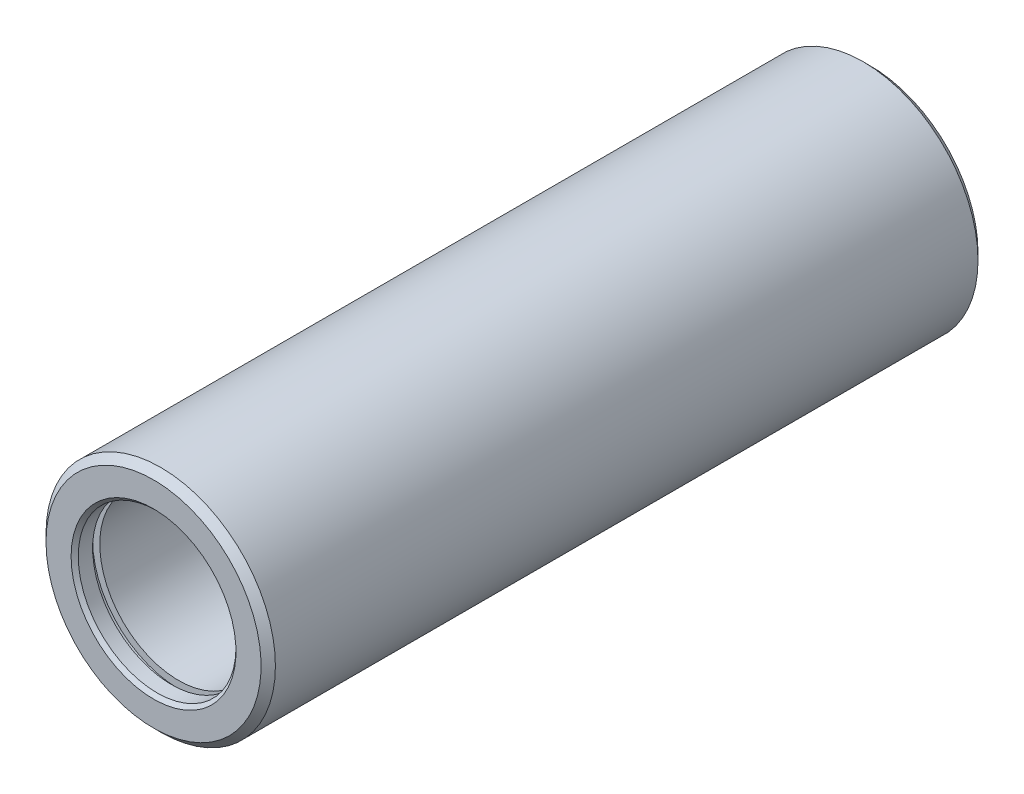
ISO-10303-21;
HEADER;
FILE_DESCRIPTION(('STEP AP214'),'2;1');
FILE_NAME('part.step','',(''),(''),'','','');
FILE_SCHEMA(('AUTOMOTIVE_DESIGN { 1 0 10303 214 1 1 1 1 }'));
ENDSEC;
DATA;
#1=APPLICATION_CONTEXT('core data for automotive mechanical design processes');
#2=APPLICATION_PROTOCOL_DEFINITION('international standard','automotive_design',2000,#1);
#3=PRODUCT_CONTEXT('',#1,'mechanical');
#4=PRODUCT('Part','Part','',(#3));
#5=PRODUCT_RELATED_PRODUCT_CATEGORY('part','',(#4));
#6=PRODUCT_DEFINITION_FORMATION('','',#4);
#7=PRODUCT_DEFINITION_CONTEXT('part definition',#1,'design');
#8=PRODUCT_DEFINITION('design','',#6,#7);
#9=PRODUCT_DEFINITION_SHAPE('','',#8);
#10=(LENGTH_UNIT() NAMED_UNIT(*) SI_UNIT(.MILLI.,.METRE.));
#11=(NAMED_UNIT(*) PLANE_ANGLE_UNIT() SI_UNIT($,.RADIAN.));
#12=(NAMED_UNIT(*) SI_UNIT($,.STERADIAN.) SOLID_ANGLE_UNIT());
#13=UNCERTAINTY_MEASURE_WITH_UNIT(LENGTH_MEASURE(1.E-05),#10,'distance_accuracy_value','');
#14=(GEOMETRIC_REPRESENTATION_CONTEXT(3) GLOBAL_UNCERTAINTY_ASSIGNED_CONTEXT((#13)) GLOBAL_UNIT_ASSIGNED_CONTEXT((#10,
#11,#12)) REPRESENTATION_CONTEXT('',''));
#15=CARTESIAN_POINT('',(0.,0.,0.));
#16=DIRECTION('',(0.,0.,1.));
#17=DIRECTION('',(1.,0.,0.));
#18=AXIS2_PLACEMENT_3D('',#15,#16,#17);
#19=CARTESIAN_POINT('',(-11.0000000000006,0.,0.));
#20=DIRECTION('',(0.,0.,-1.));
#21=DIRECTION('',(-1.,0.,0.));
#22=AXIS2_PLACEMENT_3D('',#19,#20,#21);
#23=PLANE('',#22);
#24=CARTESIAN_POINT('',(0.,0.,0.));
#25=DIRECTION('',(0.,0.,-1.));
#26=DIRECTION('',(-1.,0.,0.));
#27=AXIS2_PLACEMENT_3D('',#24,#25,#26);
#28=CIRCLE('',#27,11.5000000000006);
#29=CARTESIAN_POINT('',(-11.5000000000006,0.,0.));
#30=VERTEX_POINT('',#29);
#31=EDGE_CURVE('E10',#30,#30,#28,.T.);
#32=ORIENTED_EDGE('',*,*,#31,.T.);
#33=EDGE_LOOP('',(#32));
#34=FACE_BOUND('',#33,.T.);
#35=CARTESIAN_POINT('',(0.,0.,0.));
#36=DIRECTION('',(0.,0.,-1.));
#37=DIRECTION('',(-1.,0.,0.));
#38=AXIS2_PLACEMENT_3D('',#35,#36,#37);
#39=CIRCLE('',#38,15.);
#40=CARTESIAN_POINT('',(-15.,0.,0.));
#41=VERTEX_POINT('',#40);
#42=EDGE_CURVE('E67',#41,#41,#39,.F.);
#43=ORIENTED_EDGE('',*,*,#42,.T.);
#44=EDGE_LOOP('',(#43));
#45=FACE_BOUND('',#44,.T.);
#46=ADVANCED_FACE('F29',(#34,#45),#23,.F.);
#47=CARTESIAN_POINT('',(0.,0.,0.));
#48=DIRECTION('',(0.,0.,1.));
#49=DIRECTION('',(1.,0.,0.));
#50=AXIS2_PLACEMENT_3D('',#47,#48,#49);
#51=CYLINDRICAL_SURFACE('',#50,11.0000000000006);
#52=CARTESIAN_POINT('',(0.,0.,-0.50000000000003));
#53=DIRECTION('',(0.,0.,-1.));
#54=DIRECTION('',(-1.,0.,0.));
#55=AXIS2_PLACEMENT_3D('',#52,#53,#54);
#56=CIRCLE('',#55,11.0000000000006);
#57=CARTESIAN_POINT('',(-11.0000000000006,0.,-0.500000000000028));
#58=VERTEX_POINT('',#57);
#59=EDGE_CURVE('E36',#58,#58,#56,.F.);
#60=ORIENTED_EDGE('',*,*,#59,.T.);
#61=EDGE_LOOP('',(#60));
#62=FACE_BOUND('',#61,.T.);
#63=CARTESIAN_POINT('',(0.,0.,-2.50000000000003));
#64=DIRECTION('',(0.,0.,1.));
#65=DIRECTION('',(1.,0.,0.));
#66=AXIS2_PLACEMENT_3D('',#63,#64,#65);
#67=CIRCLE('',#66,11.0000000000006);
#68=CARTESIAN_POINT('',(11.0000000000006,0.,-2.50000000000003));
#69=VERTEX_POINT('',#68);
#70=EDGE_CURVE('E79',#69,#69,#67,.T.);
#71=ORIENTED_EDGE('',*,*,#70,.F.);
#72=EDGE_LOOP('',(#71));
#73=FACE_BOUND('',#72,.T.);
#74=ADVANCED_FACE('F184',(#62,#73),#51,.F.);
#75=CARTESIAN_POINT('',(-11.0000000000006,0.,-2.50000000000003));
#76=DIRECTION('',(0.,0.,1.));
#77=DIRECTION('',(1.,0.,0.));
#78=AXIS2_PLACEMENT_3D('',#75,#76,#77);
#79=PLANE('',#78);
#80=CARTESIAN_POINT('',(0.,0.,-2.50000000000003));
#81=DIRECTION('',(0.,0.,1.));
#82=DIRECTION('',(1.,0.,0.));
#83=AXIS2_PLACEMENT_3D('',#80,#81,#82);
#84=CIRCLE('',#83,12.0000000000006);
#85=CARTESIAN_POINT('',(12.0000000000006,0.,-2.50000000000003));
#86=VERTEX_POINT('',#85);
#87=EDGE_CURVE('E82',#86,#86,#84,.T.);
#88=ORIENTED_EDGE('',*,*,#87,.F.);
#89=EDGE_LOOP('',(#88));
#90=FACE_BOUND('',#89,.T.);
#91=ORIENTED_EDGE('',*,*,#70,.T.);
#92=EDGE_LOOP('',(#91));
#93=FACE_BOUND('',#92,.T.);
#94=ADVANCED_FACE('F189',(#90,#93),#79,.F.);
#95=CARTESIAN_POINT('',(0.,0.,0.));
#96=DIRECTION('',(0.,0.,1.));
#97=DIRECTION('',(1.,0.,0.));
#98=AXIS2_PLACEMENT_3D('',#95,#96,#97);
#99=CYLINDRICAL_SURFACE('',#98,12.0000000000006);
#100=CARTESIAN_POINT('',(0.,0.,-3.50000000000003));
#101=DIRECTION('',(0.,0.,1.));
#102=DIRECTION('',(1.,0.,0.));
#103=AXIS2_PLACEMENT_3D('',#100,#101,#102);
#104=CIRCLE('',#103,12.0000000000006);
#105=CARTESIAN_POINT('',(12.0000000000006,0.,-3.50000000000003));
#106=VERTEX_POINT('',#105);
#107=EDGE_CURVE('E85',#106,#106,#104,.T.);
#108=ORIENTED_EDGE('',*,*,#107,.F.);
#109=EDGE_LOOP('',(#108));
#110=FACE_BOUND('',#109,.T.);
#111=ORIENTED_EDGE('',*,*,#87,.T.);
#112=EDGE_LOOP('',(#111));
#113=FACE_BOUND('',#112,.T.);
#114=ADVANCED_FACE('F269',(#110,#113),#99,.F.);
#115=CARTESIAN_POINT('',(-12.0000000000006,0.,-3.50000000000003));
#116=DIRECTION('',(0.,0.,-1.));
#117=DIRECTION('',(-1.,0.,0.));
#118=AXIS2_PLACEMENT_3D('',#115,#116,#117);
#119=PLANE('',#118);
#120=CARTESIAN_POINT('',(0.,0.,-3.50000000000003));
#121=DIRECTION('',(0.,0.,1.));
#122=DIRECTION('',(1.,0.,0.));
#123=AXIS2_PLACEMENT_3D('',#120,#121,#122);
#124=CIRCLE('',#123,11.0000000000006);
#125=CARTESIAN_POINT('',(11.0000000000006,0.,-3.50000000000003));
#126=VERTEX_POINT('',#125);
#127=EDGE_CURVE('E88',#126,#126,#124,.T.);
#128=ORIENTED_EDGE('',*,*,#127,.F.);
#129=EDGE_LOOP('',(#128));
#130=FACE_BOUND('',#129,.T.);
#131=ORIENTED_EDGE('',*,*,#107,.T.);
#132=EDGE_LOOP('',(#131));
#133=FACE_BOUND('',#132,.T.);
#134=ADVANCED_FACE('F263',(#130,#133),#119,.F.);
#135=CARTESIAN_POINT('',(0.,0.,0.));
#136=DIRECTION('',(0.,0.,1.));
#137=DIRECTION('',(1.,0.,0.));
#138=AXIS2_PLACEMENT_3D('',#135,#136,#137);
#139=CYLINDRICAL_SURFACE('',#138,11.0000000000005);
#140=CARTESIAN_POINT('',(0.,0.,-26.5));
#141=DIRECTION('',(0.,0.,1.));
#142=DIRECTION('',(1.,0.,0.));
#143=AXIS2_PLACEMENT_3D('',#140,#141,#142);
#144=CIRCLE('',#143,11.0000000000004);
#145=CARTESIAN_POINT('',(11.0000000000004,0.,-26.5));
#146=VERTEX_POINT('',#145);
#147=EDGE_CURVE('E91',#146,#146,#144,.T.);
#148=ORIENTED_EDGE('',*,*,#147,.F.);
#149=EDGE_LOOP('',(#148));
#150=FACE_BOUND('',#149,.T.);
#151=ORIENTED_EDGE('',*,*,#127,.T.);
#152=EDGE_LOOP('',(#151));
#153=FACE_BOUND('',#152,.T.);
#154=ADVANCED_FACE('F257',(#150,#153),#139,.F.);
#155=CARTESIAN_POINT('',(-11.0000000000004,0.,-26.5));
#156=DIRECTION('',(0.,0.,1.));
#157=DIRECTION('',(1.,0.,0.));
#158=AXIS2_PLACEMENT_3D('',#155,#156,#157);
#159=PLANE('',#158);
#160=CARTESIAN_POINT('',(0.,0.,-26.5));
#161=DIRECTION('',(0.,0.,1.));
#162=DIRECTION('',(1.,0.,0.));
#163=AXIS2_PLACEMENT_3D('',#160,#161,#162);
#164=CIRCLE('',#163,12.0000000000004);
#165=CARTESIAN_POINT('',(12.0000000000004,0.,-26.5));
#166=VERTEX_POINT('',#165);
#167=EDGE_CURVE('E94',#166,#166,#164,.T.);
#168=ORIENTED_EDGE('',*,*,#167,.F.);
#169=EDGE_LOOP('',(#168));
#170=FACE_BOUND('',#169,.T.);
#171=ORIENTED_EDGE('',*,*,#147,.T.);
#172=EDGE_LOOP('',(#171));
#173=FACE_BOUND('',#172,.T.);
#174=ADVANCED_FACE('F251',(#170,#173),#159,.F.);
#175=CARTESIAN_POINT('',(0.,0.,0.));
#176=DIRECTION('',(0.,0.,1.));
#177=DIRECTION('',(1.,0.,0.));
#178=AXIS2_PLACEMENT_3D('',#175,#176,#177);
#179=CYLINDRICAL_SURFACE('',#178,12.0000000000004);
#180=CARTESIAN_POINT('',(0.,0.,-27.5));
#181=DIRECTION('',(0.,0.,1.));
#182=DIRECTION('',(1.,0.,0.));
#183=AXIS2_PLACEMENT_3D('',#180,#181,#182);
#184=CIRCLE('',#183,12.0000000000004);
#185=CARTESIAN_POINT('',(12.0000000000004,0.,-27.5));
#186=VERTEX_POINT('',#185);
#187=EDGE_CURVE('E97',#186,#186,#184,.T.);
#188=ORIENTED_EDGE('',*,*,#187,.F.);
#189=EDGE_LOOP('',(#188));
#190=FACE_BOUND('',#189,.T.);
#191=ORIENTED_EDGE('',*,*,#167,.T.);
#192=EDGE_LOOP('',(#191));
#193=FACE_BOUND('',#192,.T.);
#194=ADVANCED_FACE('F245',(#190,#193),#179,.F.);
#195=CARTESIAN_POINT('',(-12.0000000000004,0.,-27.5));
#196=DIRECTION('',(0.,0.,-1.));
#197=DIRECTION('',(-1.,0.,0.));
#198=AXIS2_PLACEMENT_3D('',#195,#196,#197);
#199=PLANE('',#198);
#200=CARTESIAN_POINT('',(0.,0.,-27.5));
#201=DIRECTION('',(0.,0.,1.));
#202=DIRECTION('',(1.,0.,0.));
#203=AXIS2_PLACEMENT_3D('',#200,#201,#202);
#204=CIRCLE('',#203,11.0000000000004);
#205=CARTESIAN_POINT('',(11.0000000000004,0.,-27.5));
#206=VERTEX_POINT('',#205);
#207=EDGE_CURVE('E100',#206,#206,#204,.T.);
#208=ORIENTED_EDGE('',*,*,#207,.F.);
#209=EDGE_LOOP('',(#208));
#210=FACE_BOUND('',#209,.T.);
#211=ORIENTED_EDGE('',*,*,#187,.T.);
#212=EDGE_LOOP('',(#211));
#213=FACE_BOUND('',#212,.T.);
#214=ADVANCED_FACE('F239',(#210,#213),#199,.F.);
#215=CARTESIAN_POINT('',(0.,0.,0.));
#216=DIRECTION('',(0.,0.,1.));
#217=DIRECTION('',(1.,0.,0.));
#218=AXIS2_PLACEMENT_3D('',#215,#216,#217);
#219=CYLINDRICAL_SURFACE('',#218,11.0000000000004);
#220=CARTESIAN_POINT('',(0.,0.,-29.5000000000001));
#221=DIRECTION('',(0.,0.,1.));
#222=DIRECTION('',(1.,0.,0.));
#223=AXIS2_PLACEMENT_3D('',#220,#221,#222);
#224=CIRCLE('',#223,11.0000000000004);
#225=CARTESIAN_POINT('',(11.0000000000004,0.,-29.5000000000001));
#226=VERTEX_POINT('',#225);
#227=EDGE_CURVE('E40',#226,#226,#224,.F.);
#228=ORIENTED_EDGE('',*,*,#227,.T.);
#229=EDGE_LOOP('',(#228));
#230=FACE_BOUND('',#229,.T.);
#231=ORIENTED_EDGE('',*,*,#207,.T.);
#232=EDGE_LOOP('',(#231));
#233=FACE_BOUND('',#232,.T.);
#234=ADVANCED_FACE('F180',(#230,#233),#219,.F.);
#235=CARTESIAN_POINT('',(0.,0.,0.));
#236=DIRECTION('',(0.,0.,1.));
#237=DIRECTION('',(1.,0.,0.));
#238=AXIS2_PLACEMENT_3D('',#235,#236,#237);
#239=CYLINDRICAL_SURFACE('',#238,12.);
#240=CARTESIAN_POINT('',(0.,0.,-30.5));
#241=DIRECTION('',(0.,0.,1.));
#242=DIRECTION('',(1.,0.,0.));
#243=AXIS2_PLACEMENT_3D('',#240,#241,#242);
#244=CIRCLE('',#243,12.);
#245=CARTESIAN_POINT('',(12.,0.,-30.5));
#246=VERTEX_POINT('',#245);
#247=EDGE_CURVE('E61',#246,#246,#244,.T.);
#248=ORIENTED_EDGE('',*,*,#247,.T.);
#249=EDGE_LOOP('',(#248));
#250=FACE_BOUND('',#249,.T.);
#251=CARTESIAN_POINT('',(0.,0.,-69.5));
#252=DIRECTION('',(0.,0.,-1.));
#253=DIRECTION('',(-1.,0.,0.));
#254=AXIS2_PLACEMENT_3D('',#251,#252,#253);
#255=CIRCLE('',#254,12.);
#256=CARTESIAN_POINT('',(-12.,0.,-69.5));
#257=VERTEX_POINT('',#256);
#258=EDGE_CURVE('E64',#257,#257,#255,.T.);
#259=ORIENTED_EDGE('',*,*,#258,.T.);
#260=EDGE_LOOP('',(#259));
#261=FACE_BOUND('',#260,.T.);
#262=ADVANCED_FACE('F174',(#250,#261),#239,.F.);
#263=CARTESIAN_POINT('',(0.,0.,0.));
#264=DIRECTION('',(0.,0.,1.));
#265=DIRECTION('',(1.,0.,0.));
#266=AXIS2_PLACEMENT_3D('',#263,#264,#265);
#267=CYLINDRICAL_SURFACE('',#266,11.);
#268=CARTESIAN_POINT('',(0.,0.,-70.5));
#269=DIRECTION('',(0.,0.,-1.));
#270=DIRECTION('',(-1.,0.,0.));
#271=AXIS2_PLACEMENT_3D('',#268,#269,#270);
#272=CIRCLE('',#271,11.);
#273=CARTESIAN_POINT('',(-11.,0.,-70.5));
#274=VERTEX_POINT('',#273);
#275=EDGE_CURVE('E44',#274,#274,#272,.F.);
#276=ORIENTED_EDGE('',*,*,#275,.T.);
#277=EDGE_LOOP('',(#276));
#278=FACE_BOUND('',#277,.T.);
#279=CARTESIAN_POINT('',(0.,0.,-72.5));
#280=DIRECTION('',(0.,0.,1.));
#281=DIRECTION('',(1.,0.,0.));
#282=AXIS2_PLACEMENT_3D('',#279,#280,#281);
#283=CIRCLE('',#282,11.);
#284=CARTESIAN_POINT('',(11.,0.,-72.5));
#285=VERTEX_POINT('',#284);
#286=EDGE_CURVE('E103',#285,#285,#283,.T.);
#287=ORIENTED_EDGE('',*,*,#286,.F.);
#288=EDGE_LOOP('',(#287));
#289=FACE_BOUND('',#288,.T.);
#290=ADVANCED_FACE('F169',(#278,#289),#267,.F.);
#291=CARTESIAN_POINT('',(-12.,0.,-72.5));
#292=DIRECTION('',(0.,0.,1.));
#293=DIRECTION('',(1.,0.,0.));
#294=AXIS2_PLACEMENT_3D('',#291,#292,#293);
#295=PLANE('',#294);
#296=CARTESIAN_POINT('',(0.,0.,-72.5));
#297=DIRECTION('',(0.,0.,1.));
#298=DIRECTION('',(1.,0.,0.));
#299=AXIS2_PLACEMENT_3D('',#296,#297,#298);
#300=CIRCLE('',#299,12.);
#301=CARTESIAN_POINT('',(12.,0.,-72.5));
#302=VERTEX_POINT('',#301);
#303=EDGE_CURVE('E106',#302,#302,#300,.T.);
#304=ORIENTED_EDGE('',*,*,#303,.F.);
#305=EDGE_LOOP('',(#304));
#306=FACE_BOUND('',#305,.T.);
#307=ORIENTED_EDGE('',*,*,#286,.T.);
#308=EDGE_LOOP('',(#307));
#309=FACE_BOUND('',#308,.T.);
#310=ADVANCED_FACE('F163',(#306,#309),#295,.F.);
#311=CARTESIAN_POINT('',(0.,0.,0.));
#312=DIRECTION('',(0.,0.,1.));
#313=DIRECTION('',(1.,0.,0.));
#314=AXIS2_PLACEMENT_3D('',#311,#312,#313);
#315=CYLINDRICAL_SURFACE('',#314,12.);
#316=CARTESIAN_POINT('',(0.,0.,-73.5));
#317=DIRECTION('',(0.,0.,1.));
#318=DIRECTION('',(1.,0.,0.));
#319=AXIS2_PLACEMENT_3D('',#316,#317,#318);
#320=CIRCLE('',#319,12.);
#321=CARTESIAN_POINT('',(12.,0.,-73.5));
#322=VERTEX_POINT('',#321);
#323=EDGE_CURVE('E109',#322,#322,#320,.T.);
#324=ORIENTED_EDGE('',*,*,#323,.F.);
#325=EDGE_LOOP('',(#324));
#326=FACE_BOUND('',#325,.T.);
#327=ORIENTED_EDGE('',*,*,#303,.T.);
#328=EDGE_LOOP('',(#327));
#329=FACE_BOUND('',#328,.T.);
#330=ADVANCED_FACE('F157',(#326,#329),#315,.F.);
#331=CARTESIAN_POINT('',(-11.,0.,-73.5));
#332=DIRECTION('',(0.,0.,-1.));
#333=DIRECTION('',(-1.,0.,0.));
#334=AXIS2_PLACEMENT_3D('',#331,#332,#333);
#335=PLANE('',#334);
#336=CARTESIAN_POINT('',(0.,0.,-73.5));
#337=DIRECTION('',(0.,0.,1.));
#338=DIRECTION('',(1.,0.,0.));
#339=AXIS2_PLACEMENT_3D('',#336,#337,#338);
#340=CIRCLE('',#339,11.);
#341=CARTESIAN_POINT('',(11.,0.,-73.5));
#342=VERTEX_POINT('',#341);
#343=EDGE_CURVE('E112',#342,#342,#340,.T.);
#344=ORIENTED_EDGE('',*,*,#343,.F.);
#345=EDGE_LOOP('',(#344));
#346=FACE_BOUND('',#345,.T.);
#347=ORIENTED_EDGE('',*,*,#323,.T.);
#348=EDGE_LOOP('',(#347));
#349=FACE_BOUND('',#348,.T.);
#350=ADVANCED_FACE('F151',(#346,#349),#335,.F.);
#351=CARTESIAN_POINT('',(0.,0.,0.));
#352=DIRECTION('',(0.,0.,1.));
#353=DIRECTION('',(1.,0.,0.));
#354=AXIS2_PLACEMENT_3D('',#351,#352,#353);
#355=CYLINDRICAL_SURFACE('',#354,11.);
#356=CARTESIAN_POINT('',(0.,0.,-96.5));
#357=DIRECTION('',(0.,0.,1.));
#358=DIRECTION('',(1.,0.,0.));
#359=AXIS2_PLACEMENT_3D('',#356,#357,#358);
#360=CIRCLE('',#359,11.);
#361=CARTESIAN_POINT('',(11.,0.,-96.5));
#362=VERTEX_POINT('',#361);
#363=EDGE_CURVE('E115',#362,#362,#360,.T.);
#364=ORIENTED_EDGE('',*,*,#363,.F.);
#365=EDGE_LOOP('',(#364));
#366=FACE_BOUND('',#365,.T.);
#367=ORIENTED_EDGE('',*,*,#343,.T.);
#368=EDGE_LOOP('',(#367));
#369=FACE_BOUND('',#368,.T.);
#370=ADVANCED_FACE('F145',(#366,#369),#355,.F.);
#371=CARTESIAN_POINT('',(-12.,0.,-96.5));
#372=DIRECTION('',(0.,0.,1.));
#373=DIRECTION('',(1.,0.,0.));
#374=AXIS2_PLACEMENT_3D('',#371,#372,#373);
#375=PLANE('',#374);
#376=CARTESIAN_POINT('',(0.,0.,-96.5));
#377=DIRECTION('',(0.,0.,1.));
#378=DIRECTION('',(1.,0.,0.));
#379=AXIS2_PLACEMENT_3D('',#376,#377,#378);
#380=CIRCLE('',#379,12.);
#381=CARTESIAN_POINT('',(12.,0.,-96.5));
#382=VERTEX_POINT('',#381);
#383=EDGE_CURVE('E118',#382,#382,#380,.T.);
#384=ORIENTED_EDGE('',*,*,#383,.F.);
#385=EDGE_LOOP('',(#384));
#386=FACE_BOUND('',#385,.T.);
#387=ORIENTED_EDGE('',*,*,#363,.T.);
#388=EDGE_LOOP('',(#387));
#389=FACE_BOUND('',#388,.T.);
#390=ADVANCED_FACE('F139',(#386,#389),#375,.F.);
#391=CARTESIAN_POINT('',(0.,0.,0.));
#392=DIRECTION('',(0.,0.,1.));
#393=DIRECTION('',(1.,0.,0.));
#394=AXIS2_PLACEMENT_3D('',#391,#392,#393);
#395=CYLINDRICAL_SURFACE('',#394,12.);
#396=CARTESIAN_POINT('',(0.,0.,-97.5));
#397=DIRECTION('',(0.,0.,1.));
#398=DIRECTION('',(1.,0.,0.));
#399=AXIS2_PLACEMENT_3D('',#396,#397,#398);
#400=CIRCLE('',#399,12.);
#401=CARTESIAN_POINT('',(12.,0.,-97.5));
#402=VERTEX_POINT('',#401);
#403=EDGE_CURVE('E121',#402,#402,#400,.T.);
#404=ORIENTED_EDGE('',*,*,#403,.F.);
#405=EDGE_LOOP('',(#404));
#406=FACE_BOUND('',#405,.T.);
#407=ORIENTED_EDGE('',*,*,#383,.T.);
#408=EDGE_LOOP('',(#407));
#409=FACE_BOUND('',#408,.T.);
#410=ADVANCED_FACE('F133',(#406,#409),#395,.F.);
#411=CARTESIAN_POINT('',(-11.,0.,-97.5));
#412=DIRECTION('',(0.,0.,-1.));
#413=DIRECTION('',(-1.,0.,0.));
#414=AXIS2_PLACEMENT_3D('',#411,#412,#413);
#415=PLANE('',#414);
#416=CARTESIAN_POINT('',(0.,0.,-97.5));
#417=DIRECTION('',(0.,0.,1.));
#418=DIRECTION('',(1.,0.,0.));
#419=AXIS2_PLACEMENT_3D('',#416,#417,#418);
#420=CIRCLE('',#419,11.);
#421=CARTESIAN_POINT('',(11.,0.,-97.5));
#422=VERTEX_POINT('',#421);
#423=EDGE_CURVE('E124',#422,#422,#420,.T.);
#424=ORIENTED_EDGE('',*,*,#423,.F.);
#425=EDGE_LOOP('',(#424));
#426=FACE_BOUND('',#425,.T.);
#427=ORIENTED_EDGE('',*,*,#403,.T.);
#428=EDGE_LOOP('',(#427));
#429=FACE_BOUND('',#428,.T.);
#430=ADVANCED_FACE('F130',(#426,#429),#415,.F.);
#431=CARTESIAN_POINT('',(0.,0.,0.));
#432=DIRECTION('',(0.,0.,1.));
#433=DIRECTION('',(1.,0.,0.));
#434=AXIS2_PLACEMENT_3D('',#431,#432,#433);
#435=CYLINDRICAL_SURFACE('',#434,11.);
#436=CARTESIAN_POINT('',(0.,0.,-99.5));
#437=DIRECTION('',(0.,0.,1.));
#438=DIRECTION('',(1.,0.,0.));
#439=AXIS2_PLACEMENT_3D('',#436,#437,#438);
#440=CIRCLE('',#439,11.);
#441=CARTESIAN_POINT('',(11.,0.,-99.5));
#442=VERTEX_POINT('',#441);
#443=EDGE_CURVE('E49',#442,#442,#440,.F.);
#444=ORIENTED_EDGE('',*,*,#443,.T.);
#445=EDGE_LOOP('',(#444));
#446=FACE_BOUND('',#445,.T.);
#447=ORIENTED_EDGE('',*,*,#423,.T.);
#448=EDGE_LOOP('',(#447));
#449=FACE_BOUND('',#448,.T.);
#450=ADVANCED_FACE('F128',(#446,#449),#435,.F.);
#451=CARTESIAN_POINT('',(-11.,0.,-100.));
#452=DIRECTION('',(0.,0.,1.));
#453=DIRECTION('',(1.,0.,0.));
#454=AXIS2_PLACEMENT_3D('',#451,#452,#453);
#455=PLANE('',#454);
#456=CARTESIAN_POINT('',(0.,0.,-100.));
#457=DIRECTION('',(0.,0.,1.));
#458=DIRECTION('',(1.,0.,0.));
#459=AXIS2_PLACEMENT_3D('',#456,#457,#458);
#460=CIRCLE('',#459,11.5);
#461=CARTESIAN_POINT('',(11.5,0.,-100.));
#462=VERTEX_POINT('',#461);
#463=EDGE_CURVE('E52',#462,#462,#460,.T.);
#464=ORIENTED_EDGE('',*,*,#463,.T.);
#465=EDGE_LOOP('',(#464));
#466=FACE_BOUND('',#465,.T.);
#467=CARTESIAN_POINT('',(0.,0.,-100.));
#468=DIRECTION('',(0.,0.,1.));
#469=DIRECTION('',(1.,0.,0.));
#470=AXIS2_PLACEMENT_3D('',#467,#468,#469);
#471=CIRCLE('',#470,15.);
#472=CARTESIAN_POINT('',(15.,0.,-100.));
#473=VERTEX_POINT('',#472);
#474=EDGE_CURVE('E70',#473,#473,#471,.F.);
#475=ORIENTED_EDGE('',*,*,#474,.T.);
#476=EDGE_LOOP('',(#475));
#477=FACE_BOUND('',#476,.T.);
#478=ADVANCED_FACE('F387',(#466,#477),#455,.F.);
#479=CARTESIAN_POINT('',(0.,0.,0.));
#480=DIRECTION('',(0.,0.,1.));
#481=DIRECTION('',(1.,0.,0.));
#482=AXIS2_PLACEMENT_3D('',#479,#480,#481);
#483=CYLINDRICAL_SURFACE('',#482,16.);
#484=CARTESIAN_POINT('',(0.,0.,-99.));
#485=DIRECTION('',(0.,0.,1.));
#486=DIRECTION('',(1.,0.,0.));
#487=AXIS2_PLACEMENT_3D('',#484,#485,#486);
#488=CIRCLE('',#487,16.);
#489=CARTESIAN_POINT('',(16.,0.,-99.));
#490=VERTEX_POINT('',#489);
#491=EDGE_CURVE('E73',#490,#490,#488,.T.);
#492=ORIENTED_EDGE('',*,*,#491,.T.);
#493=EDGE_LOOP('',(#492));
#494=FACE_BOUND('',#493,.T.);
#495=CARTESIAN_POINT('',(0.,0.,-1.00000000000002));
#496=DIRECTION('',(0.,0.,-1.));
#497=DIRECTION('',(-1.,0.,0.));
#498=AXIS2_PLACEMENT_3D('',#495,#496,#497);
#499=CIRCLE('',#498,16.);
#500=CARTESIAN_POINT('',(-16.,0.,-1.00000000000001));
#501=VERTEX_POINT('',#500);
#502=EDGE_CURVE('E76',#501,#501,#499,.T.);
#503=ORIENTED_EDGE('',*,*,#502,.T.);
#504=EDGE_LOOP('',(#503));
#505=FACE_BOUND('',#504,.T.);
#506=ADVANCED_FACE('F198',(#494,#505),#483,.T.);
#507=CARTESIAN_POINT('',(0.,0.,-99.));
#508=DIRECTION('',(0.,0.,1.));
#509=DIRECTION('',(1.,0.,0.));
#510=AXIS2_PLACEMENT_3D('',#507,#508,#509);
#511=CONICAL_SURFACE('',#510,16.,0.785398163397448);
#512=ORIENTED_EDGE('',*,*,#474,.F.);
#513=EDGE_LOOP('',(#512));
#514=FACE_BOUND('',#513,.T.);
#515=ORIENTED_EDGE('',*,*,#491,.F.);
#516=EDGE_LOOP('',(#515));
#517=FACE_BOUND('',#516,.T.);
#518=ADVANCED_FACE('F194',(#514,#517),#511,.T.);
#519=CARTESIAN_POINT('',(0.,0.,0.));
#520=DIRECTION('',(0.,0.,-1.));
#521=DIRECTION('',(-1.,0.,0.));
#522=AXIS2_PLACEMENT_3D('',#519,#520,#521);
#523=CONICAL_SURFACE('',#522,15.,0.785398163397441);
#524=ORIENTED_EDGE('',*,*,#502,.F.);
#525=EDGE_LOOP('',(#524));
#526=FACE_BOUND('',#525,.T.);
#527=ORIENTED_EDGE('',*,*,#42,.F.);
#528=EDGE_LOOP('',(#527));
#529=FACE_BOUND('',#528,.T.);
#530=ADVANCED_FACE('F197',(#526,#529),#523,.T.);
#531=CARTESIAN_POINT('',(0.,0.,-30.5));
#532=DIRECTION('',(0.,0.,-1.));
#533=DIRECTION('',(-1.,0.,0.));
#534=AXIS2_PLACEMENT_3D('',#531,#532,#533);
#535=CONICAL_SURFACE('',#534,12.,0.785398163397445);
#536=CARTESIAN_POINT('',(0.,0.,-30.));
#537=DIRECTION('',(0.,0.,1.));
#538=DIRECTION('',(1.,0.,0.));
#539=AXIS2_PLACEMENT_3D('',#536,#537,#538);
#540=CIRCLE('',#539,11.5);
#541=CARTESIAN_POINT('',(11.5,0.,-30.));
#542=VERTEX_POINT('',#541);
#543=EDGE_CURVE('E58',#542,#542,#540,.F.);
#544=ORIENTED_EDGE('',*,*,#543,.F.);
#545=EDGE_LOOP('',(#544));
#546=FACE_BOUND('',#545,.T.);
#547=ORIENTED_EDGE('',*,*,#247,.F.);
#548=EDGE_LOOP('',(#547));
#549=FACE_BOUND('',#548,.T.);
#550=ADVANCED_FACE('F202',(#546,#549),#535,.F.);
#551=CARTESIAN_POINT('',(0.,0.,-70.));
#552=DIRECTION('',(0.,0.,1.));
#553=DIRECTION('',(1.,0.,0.));
#554=AXIS2_PLACEMENT_3D('',#551,#552,#553);
#555=CONICAL_SURFACE('',#554,11.5,0.78539816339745);
#556=ORIENTED_EDGE('',*,*,#258,.F.);
#557=EDGE_LOOP('',(#556));
#558=FACE_BOUND('',#557,.T.);
#559=CARTESIAN_POINT('',(0.,0.,-70.));
#560=DIRECTION('',(0.,0.,-1.));
#561=DIRECTION('',(-1.,0.,0.));
#562=AXIS2_PLACEMENT_3D('',#559,#560,#561);
#563=CIRCLE('',#562,11.5);
#564=CARTESIAN_POINT('',(-11.5,0.,-70.));
#565=VERTEX_POINT('',#564);
#566=EDGE_CURVE('E55',#565,#565,#563,.F.);
#567=ORIENTED_EDGE('',*,*,#566,.F.);
#568=EDGE_LOOP('',(#567));
#569=FACE_BOUND('',#568,.T.);
#570=ADVANCED_FACE('F206',(#558,#569),#555,.F.);
#571=CARTESIAN_POINT('',(0.,0.,-100.));
#572=DIRECTION('',(0.,0.,-1.));
#573=DIRECTION('',(-1.,0.,0.));
#574=AXIS2_PLACEMENT_3D('',#571,#572,#573);
#575=CONICAL_SURFACE('',#574,11.5,0.785398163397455);
#576=ORIENTED_EDGE('',*,*,#443,.F.);
#577=EDGE_LOOP('',(#576));
#578=FACE_BOUND('',#577,.T.);
#579=ORIENTED_EDGE('',*,*,#463,.F.);
#580=EDGE_LOOP('',(#579));
#581=FACE_BOUND('',#580,.T.);
#582=ADVANCED_FACE('F210',(#578,#581),#575,.F.);
#583=CARTESIAN_POINT('',(0.,0.,-70.5));
#584=DIRECTION('',(0.,0.,1.));
#585=DIRECTION('',(1.,0.,0.));
#586=AXIS2_PLACEMENT_3D('',#583,#584,#585);
#587=CONICAL_SURFACE('',#586,11.,0.785398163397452);
#588=ORIENTED_EDGE('',*,*,#566,.T.);
#589=EDGE_LOOP('',(#588));
#590=FACE_BOUND('',#589,.T.);
#591=ORIENTED_EDGE('',*,*,#275,.F.);
#592=EDGE_LOOP('',(#591));
#593=FACE_BOUND('',#592,.T.);
#594=ADVANCED_FACE('F214',(#590,#593),#587,.F.);
#595=CARTESIAN_POINT('',(0.,0.,-30.));
#596=DIRECTION('',(0.,0.,-1.));
#597=DIRECTION('',(-1.,0.,0.));
#598=AXIS2_PLACEMENT_3D('',#595,#596,#597);
#599=CONICAL_SURFACE('',#598,11.5000000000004,0.785398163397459);
#600=ORIENTED_EDGE('',*,*,#227,.F.);
#601=EDGE_LOOP('',(#600));
#602=FACE_BOUND('',#601,.T.);
#603=ORIENTED_EDGE('',*,*,#543,.T.);
#604=EDGE_LOOP('',(#603));
#605=FACE_BOUND('',#604,.T.);
#606=ADVANCED_FACE('F217',(#602,#605),#599,.F.);
#607=CARTESIAN_POINT('',(0.,0.,-0.50000000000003));
#608=DIRECTION('',(0.,0.,1.));
#609=DIRECTION('',(1.,0.,0.));
#610=AXIS2_PLACEMENT_3D('',#607,#608,#609);
#611=CONICAL_SURFACE('',#610,11.0000000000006,0.785398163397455);
#612=ORIENTED_EDGE('',*,*,#31,.F.);
#613=EDGE_LOOP('',(#612));
#614=FACE_BOUND('',#613,.T.);
#615=ORIENTED_EDGE('',*,*,#59,.F.);
#616=EDGE_LOOP('',(#615));
#617=FACE_BOUND('',#616,.T.);
#618=ADVANCED_FACE('F31',(#614,#617),#611,.F.);
#619=CLOSED_SHELL('',(#46,#74,#94,#114,#134,#154,#174,#194,#214,#234,#262,#290,#310,#330,#350,
#370,#390,#410,#430,#450,#478,#506,#518,#530,#550,#570,#582,#594,#606,#618));
#620=MANIFOLD_SOLID_BREP('B2',#619);
#621=ADVANCED_BREP_SHAPE_REPRESENTATION('',(#18,#620),#14);
#622=SHAPE_DEFINITION_REPRESENTATION(#9,#621);
ENDSEC;
END-ISO-10303-21;
